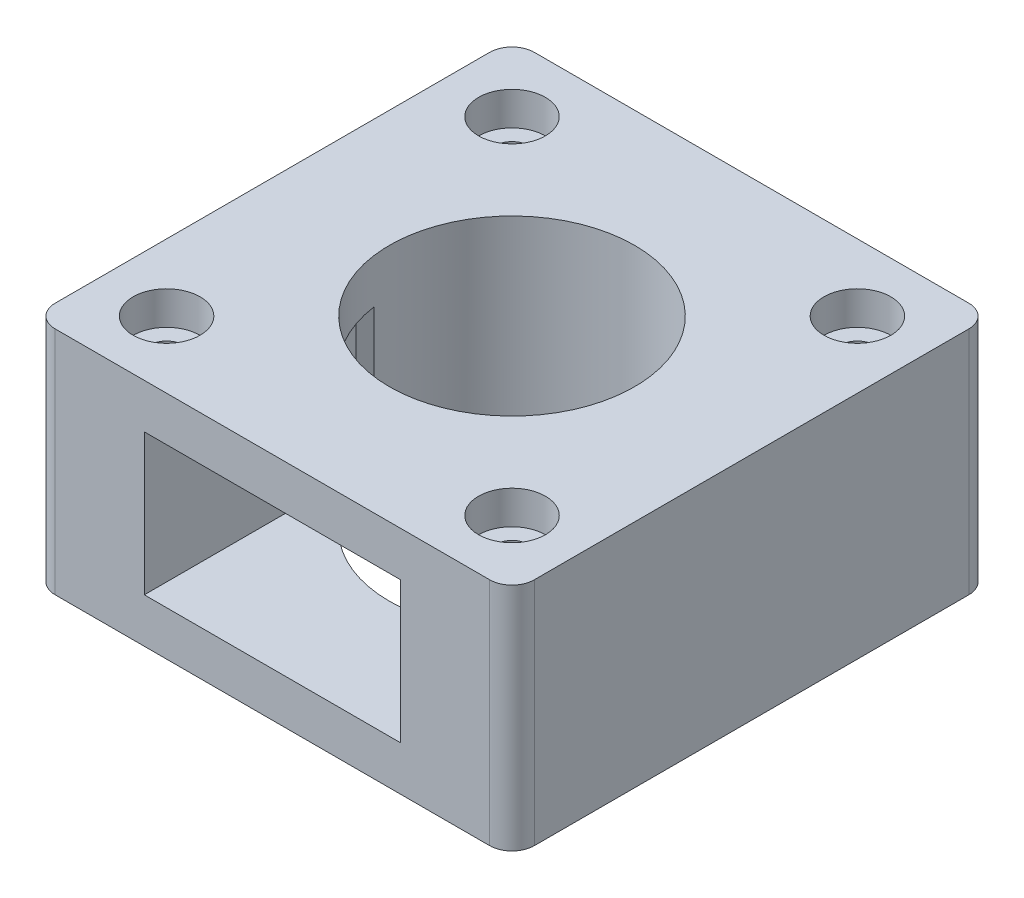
from build123d import *
from OCP.BRepFilletAPI import BRepFilletAPI_MakeChamfer

# Parameters (mm, degrees)
SKETCH1_W           = 43
SKETCH1_H           = 43
SKETCH1_R           = 11
BOSS_EXTRUDE1_DEPTH = 20.67
SKETCH2_R           = 12.5
CUT_EXTRUDE1_DEPTH  = 3
SKETCH3_R           = 1.5
CUT_EXTRUDE2_DEPTH  = 37.766137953
SKETCH4_W           = 23
SKETCH4_H           = 12.67
CUT_EXTRUDE3_DEPTH  = 20
SKETCH5_R           = 3
CUT_EXTRUDE4_DEPTH  = 3
FILLET1_R           = 2
CHAMFER1_SIZE       = 1
CHAMFER1_SIZE2      = 0.600860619


with BuildPart() as part:
    # Sketch1 → Boss-Extrude1 (new body)
    with BuildSketch(Plane(origin=(0, 0, 0), x_dir=(1, 0, 0), z_dir=(0, 1, 0))):
        Rectangle(SKETCH1_W, SKETCH1_H)
        with Locations(Location((0, 0, 0), (0, 0, 270))):
            Circle(SKETCH1_R, mode=Mode.SUBTRACT)
    extrude(amount=BOSS_EXTRUDE1_DEPTH)

    # Sketch2 → Cut-Extrude1 (cut)
    with BuildSketch(Plane.XZ):
        with Locations(Location((0, 0, 0), (0, 0, 270))):
            Circle(SKETCH2_R)
    extrude(amount=-CUT_EXTRUDE1_DEPTH, mode=Mode.SUBTRACT)

    # Sketch3 → Cut-Extrude2 (cut, through all)
    with BuildSketch(Plane(origin=(0, 20.67, 0), x_dir=(1, 0, 0), z_dir=(0, 1, 0))):
        with Locations(Location((-15.5, 15.5, 0), (0, 0, 270))):
            Circle(SKETCH3_R)
        with Locations(Location((15.5, 15.5, 0), (0, 0, 270))):
            Circle(SKETCH3_R)
        with Locations(Location((15.5, -15.5, 0), (0, 0, 270))):
            Circle(SKETCH3_R)
        with Locations(Location((-15.5, -15.5, 0), (0, 0, 270))):
            Circle(SKETCH3_R)
    extrude(amount=-CUT_EXTRUDE2_DEPTH, mode=Mode.SUBTRACT)

    # Sketch4 → Cut-Extrude3 (cut)
    with BuildSketch(Plane.XY.offset(21.5)):
        with Locations((0, 10.335)):
            Rectangle(SKETCH4_W, SKETCH4_H)
    extrude(amount=-CUT_EXTRUDE3_DEPTH, mode=Mode.SUBTRACT)

    # Sketch5 → Cut-Extrude4 (cut)
    with BuildSketch(Plane(origin=(0, 20.67, 0), x_dir=(1, 0, 0), z_dir=(0, 1, 0))):
        with Locations(Location((-15.5, 15.5, 0), (0, 0, 270))):
            Circle(SKETCH5_R)
        with Locations(Location((15.5, 15.5, 0), (0, 0, 270))):
            Circle(SKETCH5_R)
        with Locations(Location((15.5, -15.5, 0), (0, 0, 270))):
            Circle(SKETCH5_R)
        with Locations(Location((-15.5, -15.5, 0), (0, 0, 270))):
            Circle(SKETCH5_R)
    extrude(amount=-CUT_EXTRUDE4_DEPTH, mode=Mode.SUBTRACT)

    # Fillet1
    fillet1_edges = [part.edges().sort_by_distance(p)[0] for p in [
        (21.5, 10.335, 21.5),
        (-21.5, 10.335, 21.5),
        (-21.5, 10.335, -21.5),
        (21.5, 10.335, -21.5),
    ]]
    fillet(fillet1_edges, radius=FILLET1_R)

    # Chamfer1: one chamfer whose edges measure the first distance from different faces: ONE call of the kernel's chamfer builder (chamfer() names one face for all edges)
    chamfer1_edges_1 = [part.edges().sort_by_distance(p)[0] for p in [
        (11.5, 10.335, 1.5),
    ]]
    chamfer1_side_1 = [part.faces().sort_by_distance(p)[0] for p in [
        (11.5, 10.335, 11.5),
    ]]
    chamfer1_edges_2 = [part.edges().sort_by_distance(p)[0] for p in [
        (-11.5, 10.335, 1.5),
    ]]
    chamfer1_side_2 = [part.faces().sort_by_distance(p)[0] for p in [
        (-11.5, 10.335, 11.5),
    ]]
    chamfer1 = BRepFilletAPI_MakeChamfer(part.part.solid().wrapped)
    for e in chamfer1_edges_1:
        chamfer1.Add(CHAMFER1_SIZE, CHAMFER1_SIZE2, e.wrapped, chamfer1_side_1[0].wrapped)  # the first distance lies on this face
    for e in chamfer1_edges_2:
        chamfer1.Add(CHAMFER1_SIZE, CHAMFER1_SIZE2, e.wrapped, chamfer1_side_2[0].wrapped)  # the first distance lies on this face
    add(Compound.cast(chamfer1.Shape()), mode=Mode.REPLACE)


solid = part.part
